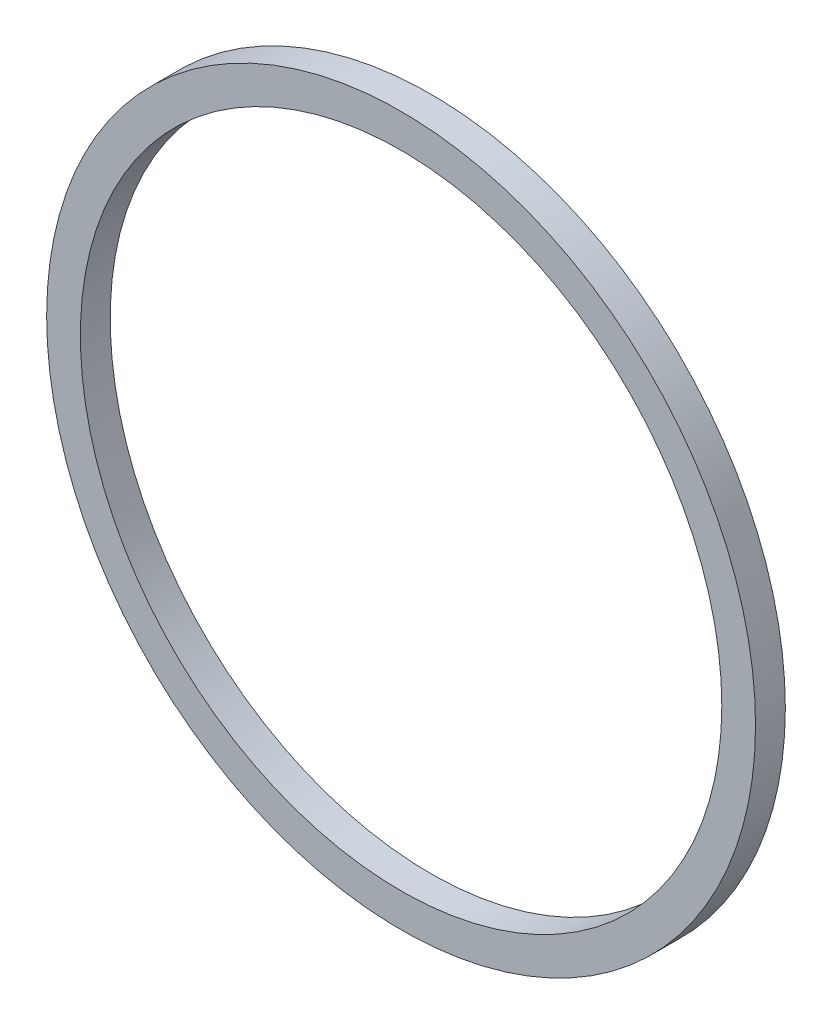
ISO-10303-21;
HEADER;
FILE_DESCRIPTION(('STEP AP214'),'2;1');
FILE_NAME('part.step','',(''),(''),'','','');
FILE_SCHEMA(('AUTOMOTIVE_DESIGN { 1 0 10303 214 1 1 1 1 }'));
ENDSEC;
DATA;
#1=APPLICATION_CONTEXT('core data for automotive mechanical design processes');
#2=APPLICATION_PROTOCOL_DEFINITION('international standard','automotive_design',2000,#1);
#3=PRODUCT_CONTEXT('',#1,'mechanical');
#4=PRODUCT('Part','Part','',(#3));
#5=PRODUCT_RELATED_PRODUCT_CATEGORY('part','',(#4));
#6=PRODUCT_DEFINITION_FORMATION('','',#4);
#7=PRODUCT_DEFINITION_CONTEXT('part definition',#1,'design');
#8=PRODUCT_DEFINITION('design','',#6,#7);
#9=PRODUCT_DEFINITION_SHAPE('','',#8);
#10=(LENGTH_UNIT() NAMED_UNIT(*) SI_UNIT(.MILLI.,.METRE.));
#11=(NAMED_UNIT(*) PLANE_ANGLE_UNIT() SI_UNIT($,.RADIAN.));
#12=(NAMED_UNIT(*) SI_UNIT($,.STERADIAN.) SOLID_ANGLE_UNIT());
#13=UNCERTAINTY_MEASURE_WITH_UNIT(LENGTH_MEASURE(1.E-05),#10,'distance_accuracy_value','');
#14=(GEOMETRIC_REPRESENTATION_CONTEXT(3) GLOBAL_UNCERTAINTY_ASSIGNED_CONTEXT((#13)) GLOBAL_UNIT_ASSIGNED_CONTEXT((#10,
#11,#12)) REPRESENTATION_CONTEXT('',''));
#15=CARTESIAN_POINT('',(0.,0.,0.));
#16=DIRECTION('',(0.,0.,1.));
#17=DIRECTION('',(1.,0.,0.));
#18=AXIS2_PLACEMENT_3D('',#15,#16,#17);
#19=CARTESIAN_POINT('',(0.,0.,1.));
#20=DIRECTION('',(0.,0.,1.));
#21=DIRECTION('',(1.,0.,0.));
#22=AXIS2_PLACEMENT_3D('',#19,#20,#21);
#23=PLANE('',#22);
#24=CARTESIAN_POINT('',(0.,0.,1.));
#25=DIRECTION('',(0.,0.,1.));
#26=DIRECTION('',(1.,0.,0.));
#27=AXIS2_PLACEMENT_3D('',#24,#25,#26);
#28=CIRCLE('',#27,11.88);
#29=CARTESIAN_POINT('',(11.88,0.,1.));
#30=VERTEX_POINT('',#29);
#31=EDGE_CURVE('E10',#30,#30,#28,.T.);
#32=ORIENTED_EDGE('',*,*,#31,.T.);
#33=EDGE_LOOP('',(#32));
#34=FACE_BOUND('',#33,.T.);
#35=CARTESIAN_POINT('',(0.,0.,1.));
#36=DIRECTION('',(0.,0.,1.));
#37=DIRECTION('',(1.,0.,0.));
#38=AXIS2_PLACEMENT_3D('',#35,#36,#37);
#39=CIRCLE('',#38,10.75);
#40=CARTESIAN_POINT('',(10.75,0.,1.));
#41=VERTEX_POINT('',#40);
#42=EDGE_CURVE('E41',#41,#41,#39,.T.);
#43=ORIENTED_EDGE('',*,*,#42,.F.);
#44=EDGE_LOOP('',(#43));
#45=FACE_BOUND('',#44,.T.);
#46=ADVANCED_FACE('F30',(#34,#45),#23,.T.);
#47=CARTESIAN_POINT('',(0.,0.,0.));
#48=DIRECTION('',(0.,0.,1.));
#49=DIRECTION('',(1.,0.,0.));
#50=AXIS2_PLACEMENT_3D('',#47,#48,#49);
#51=PLANE('',#50);
#52=CARTESIAN_POINT('',(0.,0.,0.));
#53=DIRECTION('',(0.,0.,1.));
#54=DIRECTION('',(1.,0.,0.));
#55=AXIS2_PLACEMENT_3D('',#52,#53,#54);
#56=CIRCLE('',#55,11.88);
#57=CARTESIAN_POINT('',(11.88,0.,0.));
#58=VERTEX_POINT('',#57);
#59=EDGE_CURVE('E37',#58,#58,#56,.T.);
#60=ORIENTED_EDGE('',*,*,#59,.F.);
#61=EDGE_LOOP('',(#60));
#62=FACE_BOUND('',#61,.T.);
#63=CARTESIAN_POINT('',(0.,0.,0.));
#64=DIRECTION('',(0.,0.,1.));
#65=DIRECTION('',(1.,0.,0.));
#66=AXIS2_PLACEMENT_3D('',#63,#64,#65);
#67=CIRCLE('',#66,10.75);
#68=CARTESIAN_POINT('',(10.75,0.,0.));
#69=VERTEX_POINT('',#68);
#70=EDGE_CURVE('E45',#69,#69,#67,.T.);
#71=ORIENTED_EDGE('',*,*,#70,.T.);
#72=EDGE_LOOP('',(#71));
#73=FACE_BOUND('',#72,.T.);
#74=ADVANCED_FACE('F51',(#62,#73),#51,.F.);
#75=CARTESIAN_POINT('',(0.,0.,1.));
#76=DIRECTION('',(0.,0.,-1.));
#77=DIRECTION('',(-1.,0.,0.));
#78=AXIS2_PLACEMENT_3D('',#75,#76,#77);
#79=CYLINDRICAL_SURFACE('',#78,11.88);
#80=ORIENTED_EDGE('',*,*,#31,.F.);
#81=EDGE_LOOP('',(#80));
#82=FACE_BOUND('',#81,.T.);
#83=ORIENTED_EDGE('',*,*,#59,.T.);
#84=EDGE_LOOP('',(#83));
#85=FACE_BOUND('',#84,.T.);
#86=ADVANCED_FACE('F32',(#82,#85),#79,.T.);
#87=CARTESIAN_POINT('',(0.,0.,1.));
#88=DIRECTION('',(0.,0.,-1.));
#89=DIRECTION('',(-1.,0.,0.));
#90=AXIS2_PLACEMENT_3D('',#87,#88,#89);
#91=CYLINDRICAL_SURFACE('',#90,10.75);
#92=ORIENTED_EDGE('',*,*,#42,.T.);
#93=EDGE_LOOP('',(#92));
#94=FACE_BOUND('',#93,.T.);
#95=ORIENTED_EDGE('',*,*,#70,.F.);
#96=EDGE_LOOP('',(#95));
#97=FACE_BOUND('',#96,.T.);
#98=ADVANCED_FACE('F53',(#94,#97),#91,.F.);
#99=CLOSED_SHELL('',(#46,#74,#86,#98));
#100=MANIFOLD_SOLID_BREP('B2',#99);
#101=ADVANCED_BREP_SHAPE_REPRESENTATION('',(#18,#100),#14);
#102=SHAPE_DEFINITION_REPRESENTATION(#9,#101);
ENDSEC;
END-ISO-10303-21;
